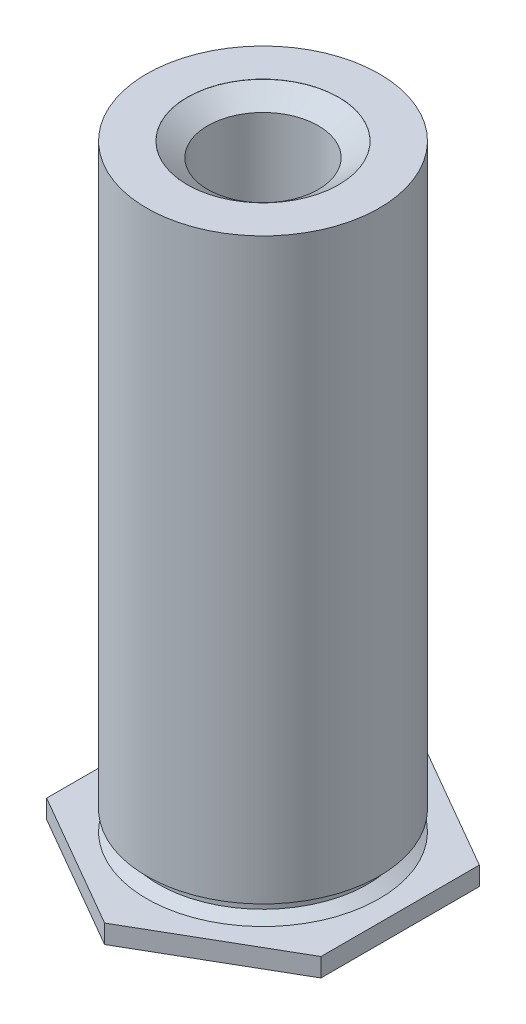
from build123d import *

# Parameters (mm, degrees)
HEXDIESKE_R  = 3.6957
HEXDIE_DEPTH = 0.430784


with BuildPart() as part:
    # BodySke → Body (revolve)
    with BuildSketch(Plane.XY, mode=Mode.PRIVATE) as body_sk:
        Polygon((2.6924, 0), (3.683, 0), (3.683, 0.430784), (2.6924, 0.430784), (2.42316, 0.586229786), (2.42316, 0.8831072), (2.6924, 0.8831072), (2.6924, 14.2748), (1.28016, 14.2748), (1.28016, 7.4168), (0, 7.4168), (0, 0.00254), (2.6924, 0.00254), align=None)
    revolve(body_sk.sketch.rotate(Axis((0, 0, 0), (0, 1, 0)), 90), axis=Axis((0, 0, 0), (0, 1, 0)))

    # TapDriSke → TapDrill (revolve, cut)
    with BuildSketch(Plane.XY, mode=Mode.PRIVATE) as tapdrill_sk:
        Polygon((1.28016, 3.4544), (1.28016, 14.2748), (0, 14.2748), (0, 2.924140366), align=None)
    revolve(tapdrill_sk.sketch.rotate(Axis((0, 0, 0), (0, 1, 0)), 90), axis=Axis((0, 0, 0), (0, 1, 0)), mode=Mode.SUBTRACT)

    # EndChamferSke → EndChamfer (revolve, cut)
    with BuildSketch(Plane.XY, mode=Mode.PRIVATE) as endchamfer_sk:
        Polygon((1.75514, 14.27226), (1.75514, 14.5288), (1.28016, 14.5288), (1.28016, 13.94157682), (1.7526, 14.27226), align=None)
    revolve(endchamfer_sk.sketch.rotate(Axis((0, -2.54, 0), (0, 1, 0)), 90), axis=Axis((0, -2.54, 0), (0, 1, 0)), mode=Mode.SUBTRACT)

    # HexDieSke → HexDie (cut)
    with BuildSketch(Plane(origin=(0, 0.430784, 0), x_dir=(-1, 0, 0), z_dir=(0, 1, 0))):
        Circle(HEXDIESKE_R)
        Polygon((0, 3.666174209), (3.175, 1.833087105), (3.175, -1.833087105), (0, -3.666174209), (-3.175, -1.833087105), (-3.175, 1.833087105), align=None, mode=Mode.SUBTRACT)
    extrude(amount=-HEXDIE_DEPTH, mode=Mode.SUBTRACT)


solid = part.part
